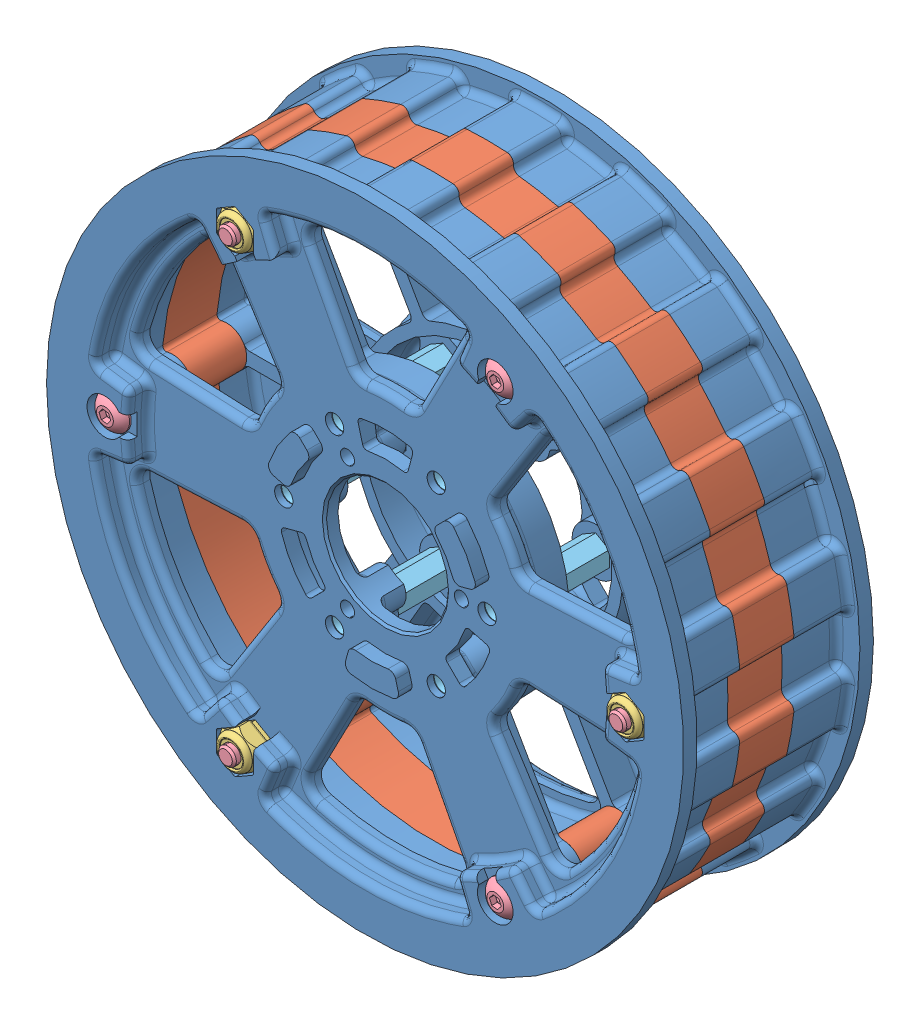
SolidWorks assembly 2_6 inch traction.SLDASM, configuration Default (file format 7000). Lengths in mm.
Overall size (184.44 184.95 48.9).
21 component instances, 5 part files, 0 mates.
Components (placement in the parent):
- 2_217-2589-001 Rev3-1: 2_217-2589-001 Rev3.sldprt [Default] at (-49.0665 5.6875 28.1222) size (149.22 149.22 19.81)
- 2_217-2589-003 Rev1-1: 2_217-2589-003 Rev1.sldprt [Default] at (-49.0665 5.6875 34.4722) x (0 0 -1) z (0.939693 0.34202 0) size (20.32 144.53 143.68)
- 2_217-2589-001 Rev3-2: 2_217-2589-001 Rev3.sldprt [Default] at (-49.0665 5.6875 40.8222) x (-1 0 0) z (0 0 -1) size (149.22 149.22 19.81)
- 2_NUT-832-NYLOCK-1: 2_NUT-832-NYLOCK.sldprt [Default] at (11.8935 5.6875 52.891) x (0.866025 0.5 0) z (0.5 -0.866025 0) size (10.2 5.86 8.12)
- 2_SCREW-832-1750-1: 2_SCREW-832-1750.sldprt [Default] at (11.8935 5.6875 12.2599) x (0 0 1) z (-1 0 0) size (46.66 7.92 7.92)
- 2_SCREW-832-1750-2: 2_SCREW-832-1750.sldprt [Default] at (-18.5865 -47.1055 56.6845) x (0 0 -1) z (0.923728 0.383049 0) size (46.66 7.92 7.92)
- 2_NUT-832-NYLOCK-2: 2_NUT-832-NYLOCK.sldprt [Default] at (-18.5865 -47.1055 16.0534) x (0 1 0) z (-1 0 0) size (10.2 5.86 8.12)
- 2_NUT-832-NYLOCK-3: 2_NUT-832-NYLOCK.sldprt [Default] at (-79.5465 58.4804 52.891) x (-0.866025 0.5 0) z (0.5 0.866025 0) size (10.2 5.86 8.12)
- 2_NUT-832-NYLOCK-4: 2_NUT-832-NYLOCK.sldprt [Default] at (-79.5465 -47.1055 52.891) x (0 -1 0) z (-1 0 0) size (10.2 5.86 8.12)
- 2_SCREW-832-1750-3: 2_SCREW-832-1750.sldprt [Default] at (-79.5465 58.4804 12.2599) x (0 0 1) z (0.5 -0.866025 0) size (46.66 7.92 7.92)
- 2_SCREW-832-1750-4: 2_SCREW-832-1750.sldprt [Default] at (-79.5465 -47.1055 12.2599) x (0 0 1) z (0.5 0.866025 0) size (46.66 7.92 7.92)
- 2_NUT-832-NYLOCK-5: 2_NUT-832-NYLOCK.sldprt [Default] at (-18.5865 58.4804 16.0534) x (-0.866025 -0.5 0) z (0.5 -0.866025 0) size (10.2 5.86 8.12)
- 2_NUT-832-NYLOCK-6: 2_NUT-832-NYLOCK.sldprt [Default] at (-110.0265 5.6875 16.0534) x (0.866025 -0.5 0) z (0.5 0.866025 0) size (10.2 5.86 8.12)
- 2_SCREW-832-1750-5: 2_SCREW-832-1750.sldprt [Default] at (-18.5865 58.4804 56.6845) x (0 0 -1) z (-0.793594 0.608447 0) size (46.66 7.92 7.92)
- 2_SCREW-832-1750-6: 2_SCREW-832-1750.sldprt [Default] at (-110.0265 5.6875 56.6845) x (0 0 -1) z (-0.130134 -0.991496 0) size (46.66 7.92 7.92)
- 2_217-2588-006 Rev1-1: 2_217-2588-006 Rev1.sldprt [Default] at (-60.9728 26.3097 34.4087) x (0 0 1) z (-0.866025 -0.5 0) size (31.75 6.35 7.33)
- 2_217-2588-006 Rev1-2: 2_217-2588-006 Rev1.sldprt [Default] at (-72.879 5.6875 34.4087) x (0 0 1) z (0 -1 0) size (31.75 6.35 7.33)
- 2_217-2588-006 Rev1-3: 2_217-2588-006 Rev1.sldprt [Default] at (-60.9728 -14.9348 34.4087) x (0 0 1) z (0.866025 -0.5 0) size (31.75 6.35 7.33)
- 2_217-2588-006 Rev1-4: 2_217-2588-006 Rev1.sldprt [Default] at (-37.1603 -14.9348 34.4087) x (0 0 1) z (0.866025 0.5 0) size (31.75 6.35 7.33)
- 2_217-2588-006 Rev1-5: 2_217-2588-006 Rev1.sldprt [Default] at (-25.254 5.6875 34.4087) x (0 0 1) z (0 1 0) size (31.75 6.35 7.33)
- 2_217-2588-006 Rev1-6: 2_217-2588-006 Rev1.sldprt [Default] at (-37.1603 26.3097 34.4087) x (0 0 1) z (-0.866025 0.5 0) size (31.75 6.35 7.33)
